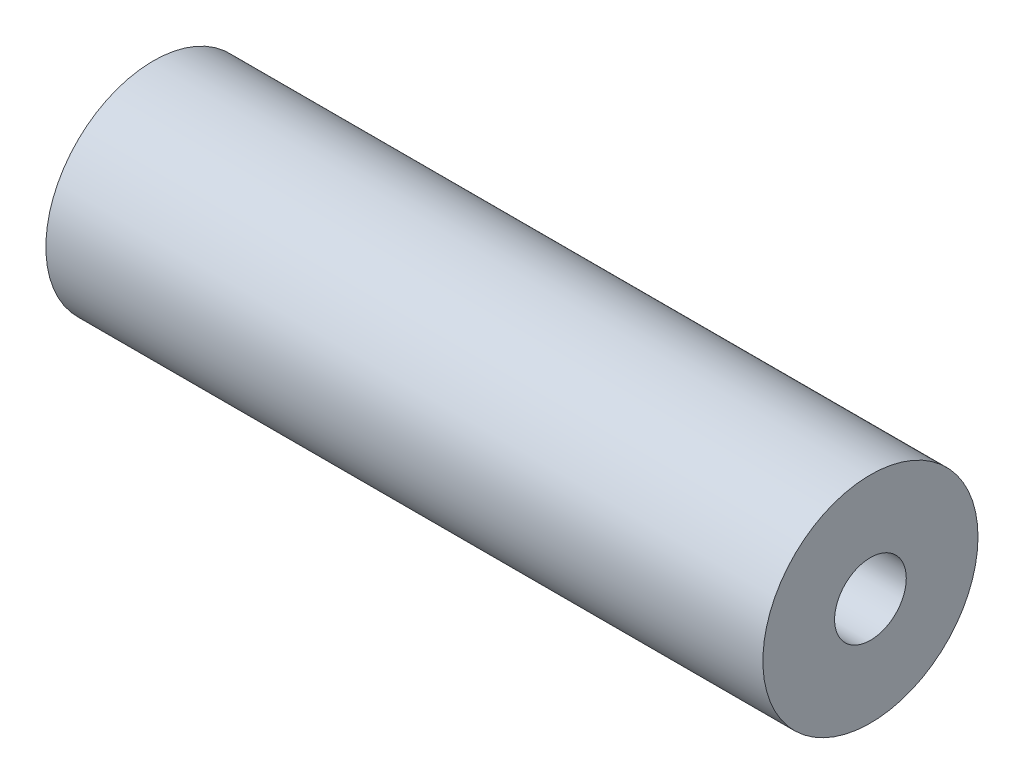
ISO-10303-21;
HEADER;
FILE_DESCRIPTION(('STEP AP214'),'2;1');
FILE_NAME('part.step','',(''),(''),'','','');
FILE_SCHEMA(('AUTOMOTIVE_DESIGN { 1 0 10303 214 1 1 1 1 }'));
ENDSEC;
DATA;
#1=APPLICATION_CONTEXT('core data for automotive mechanical design processes');
#2=APPLICATION_PROTOCOL_DEFINITION('international standard','automotive_design',2000,#1);
#3=PRODUCT_CONTEXT('',#1,'mechanical');
#4=PRODUCT('Part','Part','',(#3));
#5=PRODUCT_RELATED_PRODUCT_CATEGORY('part','',(#4));
#6=PRODUCT_DEFINITION_FORMATION('','',#4);
#7=PRODUCT_DEFINITION_CONTEXT('part definition',#1,'design');
#8=PRODUCT_DEFINITION('design','',#6,#7);
#9=PRODUCT_DEFINITION_SHAPE('','',#8);
#10=(LENGTH_UNIT() NAMED_UNIT(*) SI_UNIT(.MILLI.,.METRE.));
#11=(NAMED_UNIT(*) PLANE_ANGLE_UNIT() SI_UNIT($,.RADIAN.));
#12=(NAMED_UNIT(*) SI_UNIT($,.STERADIAN.) SOLID_ANGLE_UNIT());
#13=UNCERTAINTY_MEASURE_WITH_UNIT(LENGTH_MEASURE(1.E-05),#10,'distance_accuracy_value','');
#14=(GEOMETRIC_REPRESENTATION_CONTEXT(3) GLOBAL_UNCERTAINTY_ASSIGNED_CONTEXT((#13)) GLOBAL_UNIT_ASSIGNED_CONTEXT((#10,
#11,#12)) REPRESENTATION_CONTEXT('',''));
#15=CARTESIAN_POINT('',(0.,0.,0.));
#16=DIRECTION('',(0.,0.,1.));
#17=DIRECTION('',(1.,0.,0.));
#18=AXIS2_PLACEMENT_3D('',#15,#16,#17);
#19=CARTESIAN_POINT('',(50.,0.,0.));
#20=DIRECTION('',(1.,0.,0.));
#21=DIRECTION('',(0.,0.,-1.));
#22=AXIS2_PLACEMENT_3D('',#19,#20,#21);
#23=PLANE('',#22);
#24=CARTESIAN_POINT('',(50.,0.,0.));
#25=DIRECTION('',(1.,0.,0.));
#26=DIRECTION('',(0.,0.,-1.));
#27=AXIS2_PLACEMENT_3D('',#24,#25,#26);
#28=CIRCLE('',#27,7.5);
#29=CARTESIAN_POINT('',(50.,0.,-7.5));
#30=VERTEX_POINT('',#29);
#31=EDGE_CURVE('E10',#30,#30,#28,.T.);
#32=ORIENTED_EDGE('',*,*,#31,.T.);
#33=EDGE_LOOP('',(#32));
#34=FACE_BOUND('',#33,.T.);
#35=CARTESIAN_POINT('',(50.,0.,0.));
#36=DIRECTION('',(1.,0.,0.));
#37=DIRECTION('',(0.,0.,-1.));
#38=AXIS2_PLACEMENT_3D('',#35,#36,#37);
#39=CIRCLE('',#38,2.5);
#40=CARTESIAN_POINT('',(50.,0.,-2.5));
#41=VERTEX_POINT('',#40);
#42=EDGE_CURVE('E49',#41,#41,#39,.T.);
#43=ORIENTED_EDGE('',*,*,#42,.F.);
#44=EDGE_LOOP('',(#43));
#45=FACE_BOUND('',#44,.T.);
#46=ADVANCED_FACE('F38',(#34,#45),#23,.T.);
#47=CARTESIAN_POINT('',(0.,0.,0.));
#48=DIRECTION('',(1.,0.,0.));
#49=DIRECTION('',(0.,0.,-1.));
#50=AXIS2_PLACEMENT_3D('',#47,#48,#49);
#51=PLANE('',#50);
#52=CARTESIAN_POINT('',(0.,0.,0.));
#53=DIRECTION('',(1.,0.,0.));
#54=DIRECTION('',(0.,0.,-1.));
#55=AXIS2_PLACEMENT_3D('',#52,#53,#54);
#56=CIRCLE('',#55,7.5);
#57=CARTESIAN_POINT('',(0.,0.,-7.5));
#58=VERTEX_POINT('',#57);
#59=EDGE_CURVE('E42',#58,#58,#56,.T.);
#60=ORIENTED_EDGE('',*,*,#59,.F.);
#61=EDGE_LOOP('',(#60));
#62=FACE_BOUND('',#61,.T.);
#63=CARTESIAN_POINT('',(0.,0.,0.));
#64=DIRECTION('',(1.,0.,0.));
#65=DIRECTION('',(0.,0.,-1.));
#66=AXIS2_PLACEMENT_3D('',#63,#64,#65);
#67=CIRCLE('',#66,2.5);
#68=CARTESIAN_POINT('',(0.,0.,-2.5));
#69=VERTEX_POINT('',#68);
#70=EDGE_CURVE('E51',#69,#69,#67,.T.);
#71=ORIENTED_EDGE('',*,*,#70,.T.);
#72=EDGE_LOOP('',(#71));
#73=FACE_BOUND('',#72,.T.);
#74=ADVANCED_FACE('F61',(#62,#73),#51,.F.);
#75=CARTESIAN_POINT('',(50.,0.,0.));
#76=DIRECTION('',(-1.,0.,0.));
#77=DIRECTION('',(0.,0.,1.));
#78=AXIS2_PLACEMENT_3D('',#75,#76,#77);
#79=CYLINDRICAL_SURFACE('',#78,7.5);
#80=ORIENTED_EDGE('',*,*,#31,.F.);
#81=EDGE_LOOP('',(#80));
#82=FACE_BOUND('',#81,.T.);
#83=ORIENTED_EDGE('',*,*,#59,.T.);
#84=EDGE_LOOP('',(#83));
#85=FACE_BOUND('',#84,.T.);
#86=ADVANCED_FACE('F40',(#82,#85),#79,.T.);
#87=CARTESIAN_POINT('',(50.,0.,0.));
#88=DIRECTION('',(-1.,0.,0.));
#89=DIRECTION('',(0.,0.,1.));
#90=AXIS2_PLACEMENT_3D('',#87,#88,#89);
#91=CYLINDRICAL_SURFACE('',#90,2.5);
#92=ORIENTED_EDGE('',*,*,#42,.T.);
#93=EDGE_LOOP('',(#92));
#94=FACE_BOUND('',#93,.T.);
#95=ORIENTED_EDGE('',*,*,#70,.F.);
#96=EDGE_LOOP('',(#95));
#97=FACE_BOUND('',#96,.T.);
#98=ADVANCED_FACE('F57',(#94,#97),#91,.F.);
#99=CLOSED_SHELL('',(#46,#74,#86,#98));
#100=MANIFOLD_SOLID_BREP('B2',#99);
#101=ADVANCED_BREP_SHAPE_REPRESENTATION('',(#18,#100),#14);
#102=SHAPE_DEFINITION_REPRESENTATION(#9,#101);
ENDSEC;
END-ISO-10303-21;
